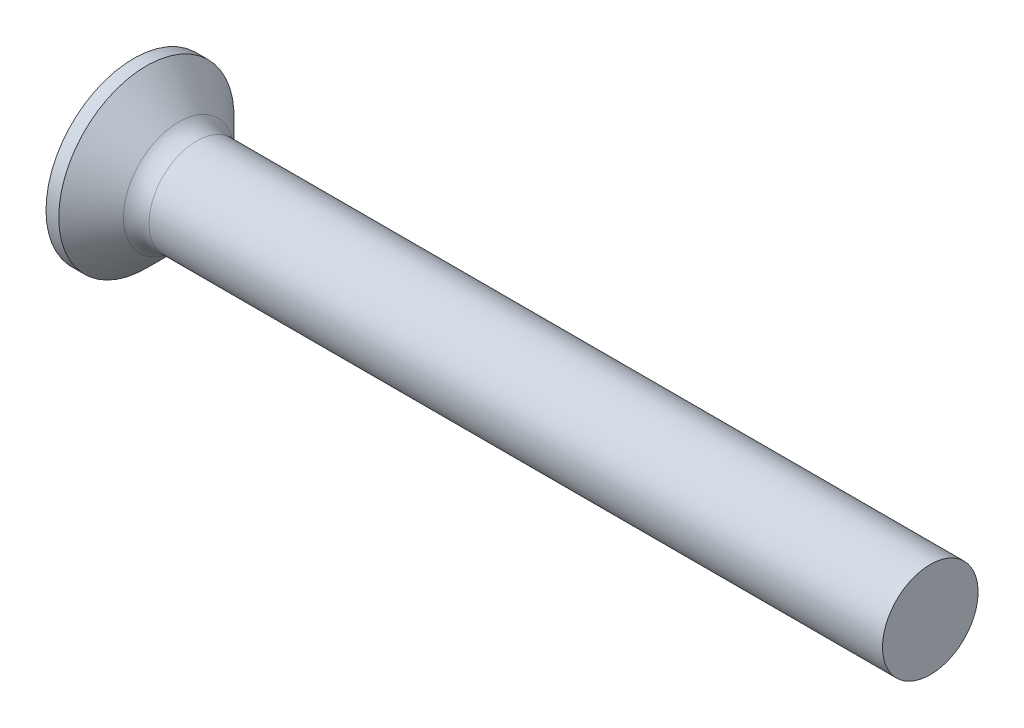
from build123d import *

# Parameters (mm, degrees)
FILLET1_R    = 0.8
RECPAT_COUNT = 2
RECPAT_ANGLE = 90


with BuildPart() as part:
    # BodySke → Base-Revolve (revolve)
    with BuildSketch(Plane.XY, mode=Mode.PRIVATE) as base_revolve_sk:
        Polygon((0, 0), (0, 2.75), (0.4, 2.75), (1.65, 1.5), (25, 1.5), (25, 0), align=None)
    revolve(base_revolve_sk.sketch.rotate(Axis((-6.35, 0, 0), (1, 0, 0)), 90), axis=Axis((-6.35, 0, 0), (1, 0, 0)))

    # Fillet1
    fillet1_edges = [part.edges().sort_by_distance(p)[0] for p in [
        (1.65, 0, -1.5),
    ]]
    fillet(fillet1_edges, radius=FILLET1_R)

    # Sketch3 → Recess section 0
    with BuildSketch(Plane.ZY):
        with BuildLine():
            Line((-0.37, 1.5), (0.37, 1.5))
            Line((0.37, 1.5), (0.37, -1.5))
            Line((0.37, -1.5), (-0.37, -1.5))
            Line((-0.37, -1.5), (-0.37, 1.5))
        make_face()
    # Sketch4 → Recess section 1
    with BuildSketch(Plane.ZY.offset(-2.01)):
        with BuildLine():
            Line((-0.37, 0.497851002), (0.37, 0.497851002))
            Line((0.37, 0.497851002), (0.37, -0.497851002))
            Line((0.37, -0.497851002), (-0.37, -0.497851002))
            Line((-0.37, -0.497851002), (-0.37, 0.497851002))
        make_face()
    recess = loft(mode=Mode.SUBTRACT)

    # RecPat: Recess ×2 about axis
    recpat_axis = Axis((0, 0, 0), (1, 0, 0))
    for i in range(1, RECPAT_COUNT):
        add(recess.rotate(recpat_axis, i * RECPAT_ANGLE / (RECPAT_COUNT - 1)), mode=Mode.SUBTRACT)

    # RecCorSke → RecessCore (revolve, cut)
    with BuildSketch(Plane.XY, mode=Mode.PRIVATE) as recesscore_sk:
        Polygon((0, 0), (0, 0.696552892), (2.01, 0.556), (2.190655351, 0), align=None)
    revolve(recesscore_sk.sketch.rotate(Axis((-3.175, 0, 0), (1, 0, 0)), 90), axis=Axis((-3.175, 0, 0), (1, 0, 0)), mode=Mode.SUBTRACT)


solid = part.part
